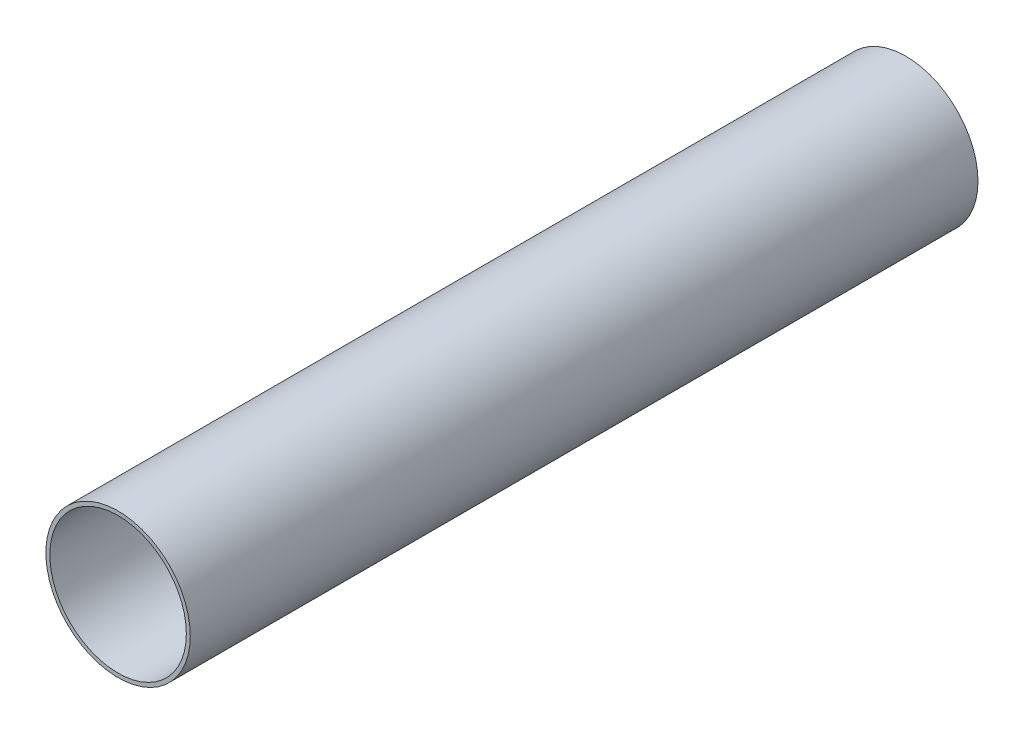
ISO-10303-21;
HEADER;
FILE_DESCRIPTION(('STEP AP214'),'2;1');
FILE_NAME('part.step','',(''),(''),'','','');
FILE_SCHEMA(('AUTOMOTIVE_DESIGN { 1 0 10303 214 1 1 1 1 }'));
ENDSEC;
DATA;
#1=APPLICATION_CONTEXT('core data for automotive mechanical design processes');
#2=APPLICATION_PROTOCOL_DEFINITION('international standard','automotive_design',2000,#1);
#3=PRODUCT_CONTEXT('',#1,'mechanical');
#4=PRODUCT('Part','Part','',(#3));
#5=PRODUCT_RELATED_PRODUCT_CATEGORY('part','',(#4));
#6=PRODUCT_DEFINITION_FORMATION('','',#4);
#7=PRODUCT_DEFINITION_CONTEXT('part definition',#1,'design');
#8=PRODUCT_DEFINITION('design','',#6,#7);
#9=PRODUCT_DEFINITION_SHAPE('','',#8);
#10=(LENGTH_UNIT() NAMED_UNIT(*) SI_UNIT(.MILLI.,.METRE.));
#11=(NAMED_UNIT(*) PLANE_ANGLE_UNIT() SI_UNIT($,.RADIAN.));
#12=(NAMED_UNIT(*) SI_UNIT($,.STERADIAN.) SOLID_ANGLE_UNIT());
#13=UNCERTAINTY_MEASURE_WITH_UNIT(LENGTH_MEASURE(1.E-05),#10,'distance_accuracy_value','');
#14=(GEOMETRIC_REPRESENTATION_CONTEXT(3) GLOBAL_UNCERTAINTY_ASSIGNED_CONTEXT((#13)) GLOBAL_UNIT_ASSIGNED_CONTEXT((#10,
#11,#12)) REPRESENTATION_CONTEXT('',''));
#15=CARTESIAN_POINT('',(0.,0.,0.));
#16=DIRECTION('',(0.,0.,1.));
#17=DIRECTION('',(1.,0.,0.));
#18=AXIS2_PLACEMENT_3D('',#15,#16,#17);
#19=CARTESIAN_POINT('',(0.,0.,1200.));
#20=DIRECTION('',(0.,0.,1.));
#21=DIRECTION('',(1.,0.,0.));
#22=AXIS2_PLACEMENT_3D('',#19,#20,#21);
#23=PLANE('',#22);
#24=CARTESIAN_POINT('',(0.,0.,1200.));
#25=DIRECTION('',(0.,0.,1.));
#26=DIRECTION('',(1.,0.,0.));
#27=AXIS2_PLACEMENT_3D('',#24,#25,#26);
#28=CIRCLE('',#27,110.);
#29=CARTESIAN_POINT('',(110.,0.,1200.));
#30=VERTEX_POINT('',#29);
#31=EDGE_CURVE('E10',#30,#30,#28,.T.);
#32=ORIENTED_EDGE('',*,*,#31,.T.);
#33=EDGE_LOOP('',(#32));
#34=FACE_BOUND('',#33,.T.);
#35=CARTESIAN_POINT('',(0.,0.,1200.));
#36=DIRECTION('',(0.,0.,1.));
#37=DIRECTION('',(1.,0.,0.));
#38=AXIS2_PLACEMENT_3D('',#35,#36,#37);
#39=CIRCLE('',#38,104.);
#40=CARTESIAN_POINT('',(104.,0.,1200.));
#41=VERTEX_POINT('',#40);
#42=EDGE_CURVE('E38',#41,#41,#39,.T.);
#43=ORIENTED_EDGE('',*,*,#42,.F.);
#44=EDGE_LOOP('',(#43));
#45=FACE_BOUND('',#44,.T.);
#46=ADVANCED_FACE('F27',(#34,#45),#23,.T.);
#47=CARTESIAN_POINT('',(0.,0.,0.));
#48=DIRECTION('',(0.,0.,1.));
#49=DIRECTION('',(1.,0.,0.));
#50=AXIS2_PLACEMENT_3D('',#47,#48,#49);
#51=PLANE('',#50);
#52=CARTESIAN_POINT('',(0.,0.,0.));
#53=DIRECTION('',(0.,0.,1.));
#54=DIRECTION('',(1.,0.,0.));
#55=AXIS2_PLACEMENT_3D('',#52,#53,#54);
#56=CIRCLE('',#55,110.);
#57=CARTESIAN_POINT('',(110.,0.,0.));
#58=VERTEX_POINT('',#57);
#59=EDGE_CURVE('E34',#58,#58,#56,.T.);
#60=ORIENTED_EDGE('',*,*,#59,.F.);
#61=EDGE_LOOP('',(#60));
#62=FACE_BOUND('',#61,.T.);
#63=CARTESIAN_POINT('',(0.,0.,0.));
#64=DIRECTION('',(0.,0.,1.));
#65=DIRECTION('',(1.,0.,0.));
#66=AXIS2_PLACEMENT_3D('',#63,#64,#65);
#67=CIRCLE('',#66,104.);
#68=CARTESIAN_POINT('',(104.,0.,0.));
#69=VERTEX_POINT('',#68);
#70=EDGE_CURVE('E42',#69,#69,#67,.T.);
#71=ORIENTED_EDGE('',*,*,#70,.T.);
#72=EDGE_LOOP('',(#71));
#73=FACE_BOUND('',#72,.T.);
#74=ADVANCED_FACE('F48',(#62,#73),#51,.F.);
#75=CARTESIAN_POINT('',(0.,0.,1200.));
#76=DIRECTION('',(0.,0.,-1.));
#77=DIRECTION('',(-1.,0.,0.));
#78=AXIS2_PLACEMENT_3D('',#75,#76,#77);
#79=CYLINDRICAL_SURFACE('',#78,110.);
#80=ORIENTED_EDGE('',*,*,#31,.F.);
#81=EDGE_LOOP('',(#80));
#82=FACE_BOUND('',#81,.T.);
#83=ORIENTED_EDGE('',*,*,#59,.T.);
#84=EDGE_LOOP('',(#83));
#85=FACE_BOUND('',#84,.T.);
#86=ADVANCED_FACE('F29',(#82,#85),#79,.T.);
#87=CARTESIAN_POINT('',(0.,0.,1200.));
#88=DIRECTION('',(0.,0.,-1.));
#89=DIRECTION('',(-1.,0.,0.));
#90=AXIS2_PLACEMENT_3D('',#87,#88,#89);
#91=CYLINDRICAL_SURFACE('',#90,104.);
#92=ORIENTED_EDGE('',*,*,#42,.T.);
#93=EDGE_LOOP('',(#92));
#94=FACE_BOUND('',#93,.T.);
#95=ORIENTED_EDGE('',*,*,#70,.F.);
#96=EDGE_LOOP('',(#95));
#97=FACE_BOUND('',#96,.T.);
#98=ADVANCED_FACE('F50',(#94,#97),#91,.F.);
#99=CLOSED_SHELL('',(#46,#74,#86,#98));
#100=MANIFOLD_SOLID_BREP('B2',#99);
#101=ADVANCED_BREP_SHAPE_REPRESENTATION('',(#18,#100),#14);
#102=SHAPE_DEFINITION_REPRESENTATION(#9,#101);
ENDSEC;
END-ISO-10303-21;
